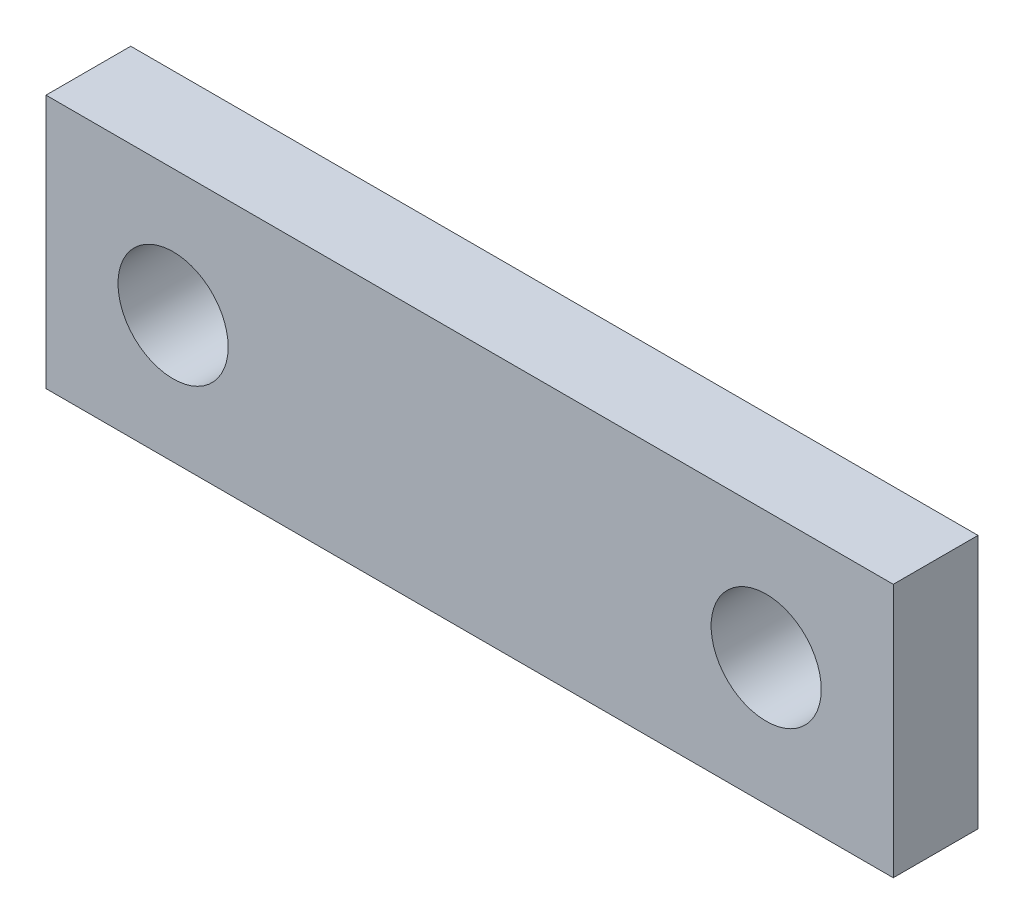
from build123d import *

# Parameters (mm, degrees)
ESQUISSE1_W             = 100
ESQUISSE1_H             = 30
EXTRUSION1_DEPTH        = 10
ESQUISSE2_R             = 6.5
ENL_V_MAT_EXTRU_1_DEPTH = 10


with BuildPart() as part:
    # Esquisse1 → Extrusion1 (new body)
    with BuildSketch(Plane.XY):
        Rectangle(ESQUISSE1_W, ESQUISSE1_H)
    extrude(amount=EXTRUSION1_DEPTH)

    # Esquisse2 → Enl_v. mat.-Extru.1 (cut)
    with BuildSketch(Plane.XY.offset(10)):
        with Locations((-35, 0)):
            Circle(ESQUISSE2_R)
        with Locations((35, 0)):
            Circle(ESQUISSE2_R)
    extrude(amount=-ENL_V_MAT_EXTRU_1_DEPTH, mode=Mode.SUBTRACT)


solid = part.part
